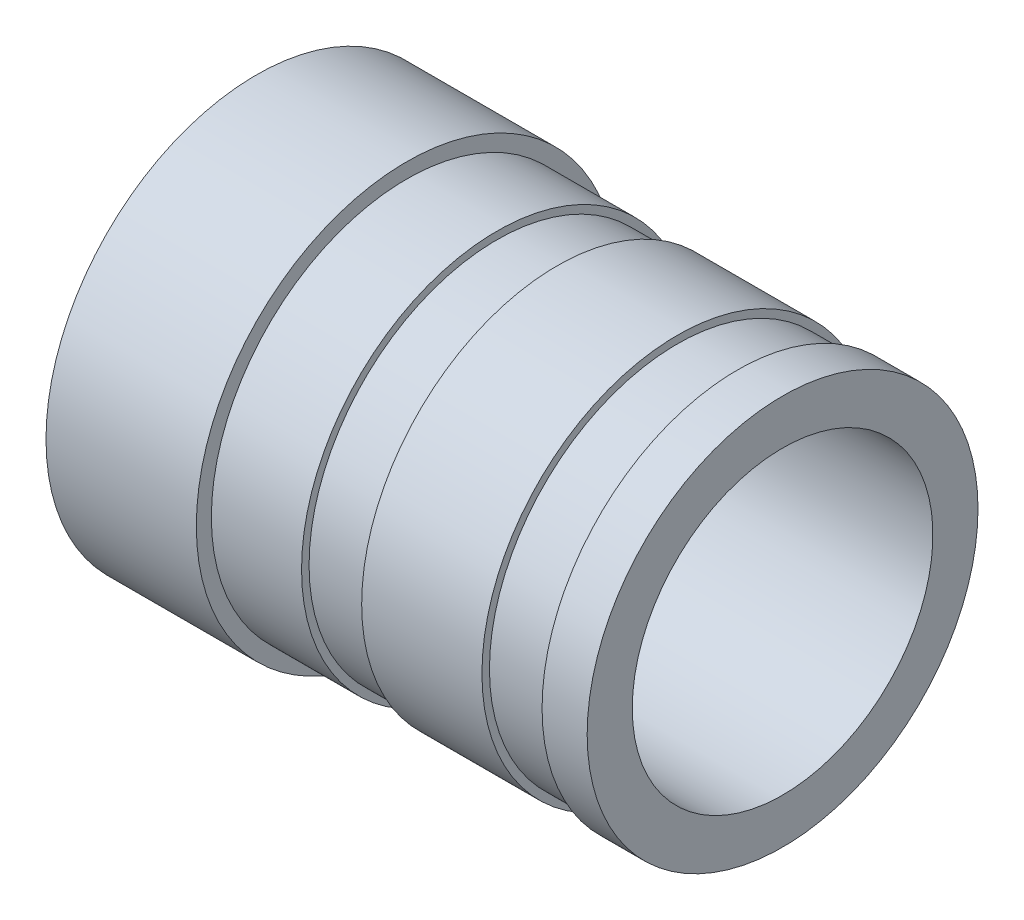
ISO-10303-21;
HEADER;
FILE_DESCRIPTION(('STEP AP214'),'2;1');
FILE_NAME('part.step','',(''),(''),'','','');
FILE_SCHEMA(('AUTOMOTIVE_DESIGN { 1 0 10303 214 1 1 1 1 }'));
ENDSEC;
DATA;
#1=APPLICATION_CONTEXT('core data for automotive mechanical design processes');
#2=APPLICATION_PROTOCOL_DEFINITION('international standard','automotive_design',2000,#1);
#3=PRODUCT_CONTEXT('',#1,'mechanical');
#4=PRODUCT('Part','Part','',(#3));
#5=PRODUCT_RELATED_PRODUCT_CATEGORY('part','',(#4));
#6=PRODUCT_DEFINITION_FORMATION('','',#4);
#7=PRODUCT_DEFINITION_CONTEXT('part definition',#1,'design');
#8=PRODUCT_DEFINITION('design','',#6,#7);
#9=PRODUCT_DEFINITION_SHAPE('','',#8);
#10=(LENGTH_UNIT() NAMED_UNIT(*) SI_UNIT(.MILLI.,.METRE.));
#11=(NAMED_UNIT(*) PLANE_ANGLE_UNIT() SI_UNIT($,.RADIAN.));
#12=(NAMED_UNIT(*) SI_UNIT($,.STERADIAN.) SOLID_ANGLE_UNIT());
#13=UNCERTAINTY_MEASURE_WITH_UNIT(LENGTH_MEASURE(1.E-05),#10,'distance_accuracy_value','');
#14=(GEOMETRIC_REPRESENTATION_CONTEXT(3) GLOBAL_UNCERTAINTY_ASSIGNED_CONTEXT((#13)) GLOBAL_UNIT_ASSIGNED_CONTEXT((#10,
#11,#12)) REPRESENTATION_CONTEXT('',''));
#15=CARTESIAN_POINT('',(0.,0.,0.));
#16=DIRECTION('',(0.,0.,1.));
#17=DIRECTION('',(1.,0.,0.));
#18=AXIS2_PLACEMENT_3D('',#15,#16,#17);
#19=CARTESIAN_POINT('',(0.,0.,0.));
#20=DIRECTION('',(-1.,0.,0.));
#21=DIRECTION('',(0.,0.,1.00000000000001));
#22=AXIS2_PLACEMENT_3D('',#19,#20,#21);
#23=CYLINDRICAL_SURFACE('',#22,13.);
#24=CARTESIAN_POINT('',(19.9999999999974,-2.98372437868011E-13,3.88578058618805E-13));
#25=DIRECTION('',(-1.,0.,0.));
#26=DIRECTION('',(0.,0.,1.00000000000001));
#27=AXIS2_PLACEMENT_3D('',#24,#25,#26);
#28=CIRCLE('',#27,13.);
#29=CARTESIAN_POINT('',(19.9999999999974,-2.95350549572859E-13,13.0000000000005));
#30=VERTEX_POINT('',#29);
#31=EDGE_CURVE('E55',#30,#30,#28,.T.);
#32=ORIENTED_EDGE('',*,*,#31,.F.);
#33=EDGE_LOOP('',(#32));
#34=FACE_BOUND('',#33,.T.);
#35=CARTESIAN_POINT('',(27.9999999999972,-1.38777878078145E-13,7.7715611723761E-13));
#36=DIRECTION('',(1.,0.,0.));
#37=DIRECTION('',(0.,0.,-1.00000000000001));
#38=AXIS2_PLACEMENT_3D('',#35,#36,#37);
#39=CIRCLE('',#38,13.);
#40=CARTESIAN_POINT('',(27.9999999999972,-1.41799766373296E-13,-12.9999999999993));
#41=VERTEX_POINT('',#40);
#42=EDGE_CURVE('E65',#41,#41,#39,.T.);
#43=ORIENTED_EDGE('',*,*,#42,.F.);
#44=EDGE_LOOP('',(#43));
#45=FACE_BOUND('',#44,.T.);
#46=ADVANCED_FACE('F38',(#34,#45),#23,.T.);
#47=CARTESIAN_POINT('',(9.99999999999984,0.,0.));
#48=DIRECTION('',(-1.,0.,0.));
#49=DIRECTION('',(0.,0.,1.00000000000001));
#50=AXIS2_PLACEMENT_3D('',#47,#48,#49);
#51=CIRCLE('',#50,13.);
#52=CARTESIAN_POINT('',(9.99999999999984,0.,13.0000000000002));
#53=VERTEX_POINT('',#52);
#54=EDGE_CURVE('E51',#53,#53,#51,.T.);
#55=ORIENTED_EDGE('',*,*,#54,.F.);
#56=EDGE_LOOP('',(#55));
#57=FACE_BOUND('',#56,.T.);
#58=CARTESIAN_POINT('',(15.9999999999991,-1.38777878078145E-13,1.38777878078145E-13));
#59=DIRECTION('',(1.,0.,0.));
#60=DIRECTION('',(0.,0.,-1.00000000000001));
#61=AXIS2_PLACEMENT_3D('',#58,#59,#60);
#62=CIRCLE('',#61,13.);
#63=CARTESIAN_POINT('',(15.9999999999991,-1.41799766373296E-13,-13.));
#64=VERTEX_POINT('',#63);
#65=EDGE_CURVE('E58',#64,#64,#62,.T.);
#66=ORIENTED_EDGE('',*,*,#65,.F.);
#67=EDGE_LOOP('',(#66));
#68=FACE_BOUND('',#67,.T.);
#69=ADVANCED_FACE('F92',(#57,#68),#23,.T.);
#70=CARTESIAN_POINT('',(0.,0.,0.));
#71=DIRECTION('',(1.,0.,0.));
#72=DIRECTION('',(0.,0.,-1.00000000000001));
#73=AXIS2_PLACEMENT_3D('',#70,#71,#72);
#74=PLANE('',#73);
#75=CARTESIAN_POINT('',(0.,0.,0.));
#76=DIRECTION('',(-1.,0.,0.));
#77=DIRECTION('',(0.,0.,1.00000000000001));
#78=AXIS2_PLACEMENT_3D('',#75,#76,#77);
#79=CIRCLE('',#78,5.);
#80=CARTESIAN_POINT('',(0.,0.,5.00000000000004));
#81=VERTEX_POINT('',#80);
#82=EDGE_CURVE('E168',#81,#81,#79,.T.);
#83=ORIENTED_EDGE('',*,*,#82,.F.);
#84=EDGE_LOOP('',(#83));
#85=FACE_BOUND('',#84,.T.);
#86=CARTESIAN_POINT('',(0.,0.,0.));
#87=DIRECTION('',(-1.,0.,0.));
#88=DIRECTION('',(0.,0.,1.00000000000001));
#89=AXIS2_PLACEMENT_3D('',#86,#87,#88);
#90=CIRCLE('',#89,14.);
#91=CARTESIAN_POINT('',(0.,0.,14.0000000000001));
#92=VERTEX_POINT('',#91);
#93=EDGE_CURVE('E12',#92,#92,#90,.T.);
#94=ORIENTED_EDGE('',*,*,#93,.T.);
#95=EDGE_LOOP('',(#94));
#96=FACE_BOUND('',#95,.T.);
#97=ADVANCED_FACE('F40',(#85,#96),#74,.F.);
#98=CARTESIAN_POINT('',(0.,0.,0.));
#99=DIRECTION('',(-1.,0.,0.));
#100=DIRECTION('',(0.,0.,1.00000000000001));
#101=AXIS2_PLACEMENT_3D('',#98,#99,#100);
#102=CYLINDRICAL_SURFACE('',#101,14.);
#103=ORIENTED_EDGE('',*,*,#93,.F.);
#104=EDGE_LOOP('',(#103));
#105=FACE_BOUND('',#104,.T.);
#106=CARTESIAN_POINT('',(9.99999999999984,0.,0.));
#107=DIRECTION('',(-1.,0.,0.));
#108=DIRECTION('',(0.,0.,1.00000000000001));
#109=AXIS2_PLACEMENT_3D('',#106,#107,#108);
#110=CIRCLE('',#109,14.);
#111=CARTESIAN_POINT('',(9.99999999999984,0.,14.0000000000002));
#112=VERTEX_POINT('',#111);
#113=EDGE_CURVE('E46',#112,#112,#110,.T.);
#114=ORIENTED_EDGE('',*,*,#113,.T.);
#115=EDGE_LOOP('',(#114));
#116=FACE_BOUND('',#115,.T.);
#117=ADVANCED_FACE('F112',(#105,#116),#102,.T.);
#118=CARTESIAN_POINT('',(9.99999999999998,14.,0.));
#119=DIRECTION('',(-1.,0.,0.));
#120=DIRECTION('',(0.,0.,1.00000000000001));
#121=AXIS2_PLACEMENT_3D('',#118,#119,#120);
#122=PLANE('',#121);
#123=ORIENTED_EDGE('',*,*,#113,.F.);
#124=EDGE_LOOP('',(#123));
#125=FACE_BOUND('',#124,.T.);
#126=ORIENTED_EDGE('',*,*,#54,.T.);
#127=EDGE_LOOP('',(#126));
#128=FACE_BOUND('',#127,.T.);
#129=ADVANCED_FACE('F90',(#125,#128),#122,.F.);
#130=CARTESIAN_POINT('',(15.9999999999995,27.8988533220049,1.66533453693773E-13));
#131=DIRECTION('',(1.,0.,0.));
#132=DIRECTION('',(0.,0.,-1.00000000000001));
#133=AXIS2_PLACEMENT_3D('',#130,#131,#132);
#134=PLANE('',#133);
#135=CARTESIAN_POINT('',(15.9999999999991,-1.38777878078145E-13,1.38777878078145E-13));
#136=DIRECTION('',(-1.,0.,0.));
#137=DIRECTION('',(0.,0.,1.00000000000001));
#138=AXIS2_PLACEMENT_3D('',#135,#136,#137);
#139=CIRCLE('',#138,12.5);
#140=CARTESIAN_POINT('',(15.9999999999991,-1.35872216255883E-13,12.5000000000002));
#141=VERTEX_POINT('',#140);
#142=EDGE_CURVE('E59',#141,#141,#139,.T.);
#143=ORIENTED_EDGE('',*,*,#142,.T.);
#144=EDGE_LOOP('',(#143));
#145=FACE_BOUND('',#144,.T.);
#146=ORIENTED_EDGE('',*,*,#65,.T.);
#147=EDGE_LOOP('',(#146));
#148=FACE_BOUND('',#147,.T.);
#149=ADVANCED_FACE('F99',(#145,#148),#134,.T.);
#150=CARTESIAN_POINT('',(19.9999999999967,27.8988533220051,1.30451205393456E-12));
#151=DIRECTION('',(-1.,0.,0.));
#152=DIRECTION('',(0.,0.,1.00000000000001));
#153=AXIS2_PLACEMENT_3D('',#150,#151,#152);
#154=PLANE('',#153);
#155=CARTESIAN_POINT('',(19.9999999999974,-2.98372437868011E-13,3.88578058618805E-13));
#156=DIRECTION('',(-1.,0.,0.));
#157=DIRECTION('',(0.,0.,1.00000000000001));
#158=AXIS2_PLACEMENT_3D('',#155,#156,#157);
#159=CIRCLE('',#158,12.5);
#160=CARTESIAN_POINT('',(19.9999999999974,-2.9546677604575E-13,12.5000000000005));
#161=VERTEX_POINT('',#160);
#162=EDGE_CURVE('E68',#161,#161,#159,.T.);
#163=ORIENTED_EDGE('',*,*,#162,.F.);
#164=EDGE_LOOP('',(#163));
#165=FACE_BOUND('',#164,.T.);
#166=ORIENTED_EDGE('',*,*,#31,.T.);
#167=EDGE_LOOP('',(#166));
#168=FACE_BOUND('',#167,.T.);
#169=ADVANCED_FACE('F101',(#165,#168),#154,.T.);
#170=CARTESIAN_POINT('',(0.,0.,0.));
#171=DIRECTION('',(-1.,0.,0.));
#172=DIRECTION('',(0.,0.,1.00000000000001));
#173=AXIS2_PLACEMENT_3D('',#170,#171,#172);
#174=CYLINDRICAL_SURFACE('',#173,12.5);
#175=ORIENTED_EDGE('',*,*,#162,.T.);
#176=EDGE_LOOP('',(#175));
#177=FACE_BOUND('',#176,.T.);
#178=ORIENTED_EDGE('',*,*,#142,.F.);
#179=EDGE_LOOP('',(#178));
#180=FACE_BOUND('',#179,.T.);
#181=ADVANCED_FACE('F108',(#177,#180),#174,.T.);
#182=CARTESIAN_POINT('',(27.9999999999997,30.1998314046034,0.));
#183=DIRECTION('',(1.,0.,0.));
#184=DIRECTION('',(0.,0.,-1.00000000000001));
#185=AXIS2_PLACEMENT_3D('',#182,#183,#184);
#186=PLANE('',#185);
#187=CARTESIAN_POINT('',(27.9999999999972,-1.38777878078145E-13,7.7715611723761E-13));
#188=DIRECTION('',(-1.,0.,0.));
#189=DIRECTION('',(0.,0.,1.00000000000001));
#190=AXIS2_PLACEMENT_3D('',#187,#188,#189);
#191=CIRCLE('',#190,12.5);
#192=CARTESIAN_POINT('',(27.9999999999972,-1.35872216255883E-13,12.5000000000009));
#193=VERTEX_POINT('',#192);
#194=EDGE_CURVE('E66',#193,#193,#191,.T.);
#195=ORIENTED_EDGE('',*,*,#194,.T.);
#196=EDGE_LOOP('',(#195));
#197=FACE_BOUND('',#196,.T.);
#198=ORIENTED_EDGE('',*,*,#42,.T.);
#199=EDGE_LOOP('',(#198));
#200=FACE_BOUND('',#199,.T.);
#201=ADVANCED_FACE('F142',(#197,#200),#186,.T.);
#202=CARTESIAN_POINT('',(31.9999999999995,30.1998314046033,0.));
#203=DIRECTION('',(-1.,0.,0.));
#204=DIRECTION('',(0.,0.,1.00000000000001));
#205=AXIS2_PLACEMENT_3D('',#202,#203,#204);
#206=PLANE('',#205);
#207=CARTESIAN_POINT('',(31.9999999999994,0.,1.11022302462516E-13));
#208=DIRECTION('',(-1.,0.,0.));
#209=DIRECTION('',(0.,0.,1.00000000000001));
#210=AXIS2_PLACEMENT_3D('',#207,#208,#209);
#211=CIRCLE('',#210,12.5);
#212=CARTESIAN_POINT('',(31.9999999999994,0.,12.5000000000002));
#213=VERTEX_POINT('',#212);
#214=EDGE_CURVE('E165',#213,#213,#211,.T.);
#215=ORIENTED_EDGE('',*,*,#214,.F.);
#216=EDGE_LOOP('',(#215));
#217=FACE_BOUND('',#216,.T.);
#218=CARTESIAN_POINT('',(31.9999999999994,0.,1.11022302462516E-13));
#219=DIRECTION('',(-1.,0.,0.));
#220=DIRECTION('',(0.,0.,1.00000000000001));
#221=AXIS2_PLACEMENT_3D('',#218,#219,#220);
#222=CIRCLE('',#221,13.);
#223=CARTESIAN_POINT('',(31.9999999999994,0.,13.0000000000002));
#224=VERTEX_POINT('',#223);
#225=EDGE_CURVE('E63',#224,#224,#222,.T.);
#226=ORIENTED_EDGE('',*,*,#225,.T.);
#227=EDGE_LOOP('',(#226));
#228=FACE_BOUND('',#227,.T.);
#229=ADVANCED_FACE('F139',(#217,#228),#206,.T.);
#230=CARTESIAN_POINT('',(0.,0.,0.));
#231=DIRECTION('',(-1.,0.,0.));
#232=DIRECTION('',(0.,0.,1.00000000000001));
#233=AXIS2_PLACEMENT_3D('',#230,#231,#232);
#234=CYLINDRICAL_SURFACE('',#233,12.5);
#235=ORIENTED_EDGE('',*,*,#214,.T.);
#236=EDGE_LOOP('',(#235));
#237=FACE_BOUND('',#236,.T.);
#238=ORIENTED_EDGE('',*,*,#194,.F.);
#239=EDGE_LOOP('',(#238));
#240=FACE_BOUND('',#239,.T.);
#241=ADVANCED_FACE('F141',(#237,#240),#234,.T.);
#242=CARTESIAN_POINT('',(15.8,9.99999999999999,0.));
#243=DIRECTION('',(-1.,0.,0.));
#244=DIRECTION('',(0.,0.,1.00000000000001));
#245=AXIS2_PLACEMENT_3D('',#242,#243,#244);
#246=PLANE('',#245);
#247=CARTESIAN_POINT('',(15.7999999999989,-1.17961196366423E-13,8.04911692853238E-13));
#248=DIRECTION('',(-1.,0.,0.));
#249=DIRECTION('',(0.,0.,1.00000000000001));
#250=AXIS2_PLACEMENT_3D('',#247,#248,#249);
#251=CIRCLE('',#250,5.);
#252=CARTESIAN_POINT('',(15.7999999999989,-1.16798931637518E-13,5.00000000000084));
#253=VERTEX_POINT('',#252);
#254=EDGE_CURVE('E42',#253,#253,#251,.T.);
#255=ORIENTED_EDGE('',*,*,#254,.T.);
#256=EDGE_LOOP('',(#255));
#257=FACE_BOUND('',#256,.T.);
#258=CARTESIAN_POINT('',(15.7999999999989,-1.17961196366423E-13,8.04911692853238E-13));
#259=DIRECTION('',(-1.,0.,0.));
#260=DIRECTION('',(0.,0.,1.00000000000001));
#261=AXIS2_PLACEMENT_3D('',#258,#259,#260);
#262=CIRCLE('',#261,10.);
#263=CARTESIAN_POINT('',(15.7999999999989,-1.15636666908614E-13,10.0000000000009));
#264=VERTEX_POINT('',#263);
#265=EDGE_CURVE('E62',#264,#264,#262,.T.);
#266=ORIENTED_EDGE('',*,*,#265,.F.);
#267=EDGE_LOOP('',(#266));
#268=FACE_BOUND('',#267,.T.);
#269=ADVANCED_FACE('F149',(#257,#268),#246,.F.);
#270=CARTESIAN_POINT('',(0.,0.,0.));
#271=DIRECTION('',(-1.,0.,0.));
#272=DIRECTION('',(0.,0.,1.00000000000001));
#273=AXIS2_PLACEMENT_3D('',#270,#271,#272);
#274=CYLINDRICAL_SURFACE('',#273,10.);
#275=CARTESIAN_POINT('',(34.9999999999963,-7.7715611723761E-13,9.71445146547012E-13));
#276=DIRECTION('',(-1.,0.,0.));
#277=DIRECTION('',(0.,0.,1.00000000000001));
#278=AXIS2_PLACEMENT_3D('',#275,#276,#277);
#279=CIRCLE('',#278,10.);
#280=CARTESIAN_POINT('',(34.9999999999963,-7.74831587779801E-13,10.000000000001));
#281=VERTEX_POINT('',#280);
#282=EDGE_CURVE('E82',#281,#281,#279,.T.);
#283=ORIENTED_EDGE('',*,*,#282,.F.);
#284=EDGE_LOOP('',(#283));
#285=FACE_BOUND('',#284,.T.);
#286=ORIENTED_EDGE('',*,*,#265,.T.);
#287=EDGE_LOOP('',(#286));
#288=FACE_BOUND('',#287,.T.);
#289=ADVANCED_FACE('F133',(#285,#288),#274,.F.);
#290=CARTESIAN_POINT('',(34.999999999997,9.99999999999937,1.38777878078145E-12));
#291=DIRECTION('',(-1.,0.,0.));
#292=DIRECTION('',(0.,0.,1.00000000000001));
#293=AXIS2_PLACEMENT_3D('',#290,#291,#292);
#294=PLANE('',#293);
#295=CARTESIAN_POINT('',(34.9999999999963,-7.7715611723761E-13,9.71445146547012E-13));
#296=DIRECTION('',(-1.,0.,0.));
#297=DIRECTION('',(0.,0.,1.00000000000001));
#298=AXIS2_PLACEMENT_3D('',#295,#296,#297);
#299=CIRCLE('',#298,13.);
#300=CARTESIAN_POINT('',(34.9999999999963,-7.74134228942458E-13,13.0000000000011));
#301=VERTEX_POINT('',#300);
#302=EDGE_CURVE('E85',#301,#301,#299,.T.);
#303=ORIENTED_EDGE('',*,*,#302,.F.);
#304=EDGE_LOOP('',(#303));
#305=FACE_BOUND('',#304,.T.);
#306=ORIENTED_EDGE('',*,*,#282,.T.);
#307=EDGE_LOOP('',(#306));
#308=FACE_BOUND('',#307,.T.);
#309=ADVANCED_FACE('F125',(#305,#308),#294,.F.);
#310=ORIENTED_EDGE('',*,*,#302,.T.);
#311=EDGE_LOOP('',(#310));
#312=FACE_BOUND('',#311,.T.);
#313=ORIENTED_EDGE('',*,*,#225,.F.);
#314=EDGE_LOOP('',(#313));
#315=FACE_BOUND('',#314,.T.);
#316=ADVANCED_FACE('F96',(#312,#315),#23,.T.);
#317=CARTESIAN_POINT('',(34.9999999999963,-7.7715611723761E-13,9.71445146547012E-13));
#318=DIRECTION('',(-1.,0.,0.));
#319=DIRECTION('',(0.,0.,1.00000000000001));
#320=AXIS2_PLACEMENT_3D('',#317,#318,#319);
#321=CYLINDRICAL_SURFACE('',#320,5.);
#322=ORIENTED_EDGE('',*,*,#82,.T.);
#323=EDGE_LOOP('',(#322));
#324=FACE_BOUND('',#323,.T.);
#325=ORIENTED_EDGE('',*,*,#254,.F.);
#326=EDGE_LOOP('',(#325));
#327=FACE_BOUND('',#326,.T.);
#328=ADVANCED_FACE('F124',(#324,#327),#321,.F.);
#329=CLOSED_SHELL('',(#46,#69,#97,#117,#129,#149,#169,#181,#201,#229,#241,#269,#289,#309,#316,#328));
#330=MANIFOLD_SOLID_BREP('B2',#329);
#331=ADVANCED_BREP_SHAPE_REPRESENTATION('',(#18,#330),#14);
#332=SHAPE_DEFINITION_REPRESENTATION(#9,#331);
ENDSEC;
END-ISO-10303-21;
